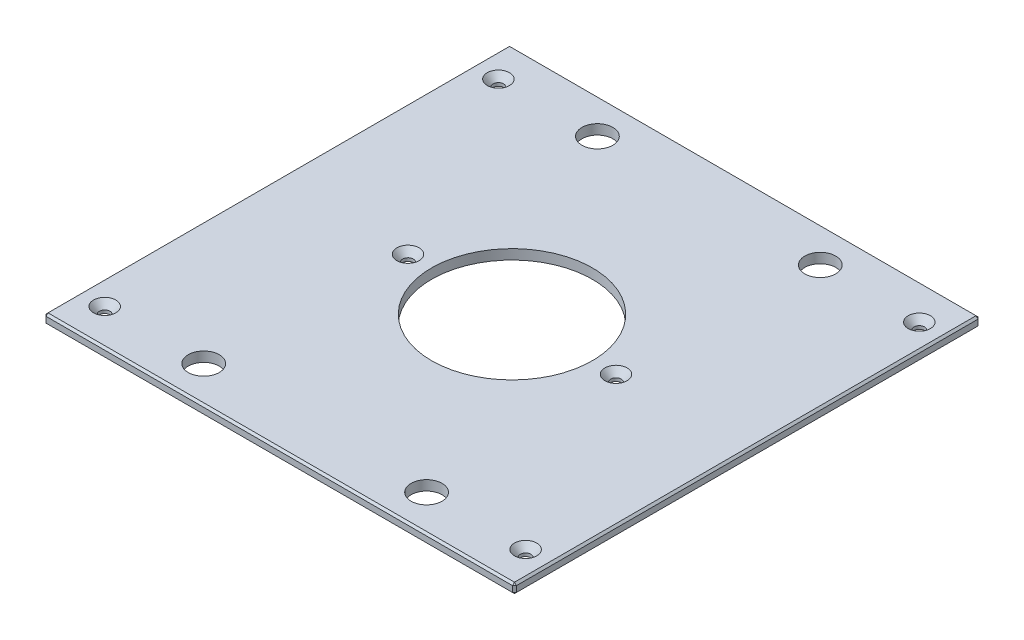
from build123d import *

# Parameters (mm, degrees)
SKETCH1_W                                     = 301.625
SKETCH1_H                                     = 298.45
BOSS_EXTRUDE1_DEPTH                           = 6.35
SKETCH13_R                                    = 51.562
CUT_EXTRUDE6_DEPTH                            = 213.256527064
F_25_32_0_78125_DIAMETER_HOLE1_D              = 19.84375
CHAMFER2_SIZE                                 = 1.27
CSK_FOR_1_4_FLAT_HEAD_MACHINE_SCREW1_AT_COUNT = 2
CSK_FOR_1_4_FLAT_HEAD_MACHINE_SCREW1_AT_PITCH = 252.40996
CSK_FOR_1_4_FLAT_HEAD_MACHINE_SCREW1_2_COUNT  = 2
CSK_FOR_1_4_FLAT_HEAD_MACHINE_SCREW1_2_PITCH  = 369.517663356
CSK_FOR_1_4_FLAT_HEAD_MACHINE_SCREW1_3_COUNT  = 2
CSK_FOR_1_4_FLAT_HEAD_MACHINE_SCREW1_3_PITCH  = 237.855622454
CSK_FOR_1_4_FLAT_HEAD_MACHINE_SCREW1_4_COUNT  = 2
CSK_FOR_1_4_FLAT_HEAD_MACHINE_SCREW1_4_PITCH  = 143.483329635
CSK_FOR_1_4_FLAT_HEAD_MACHINE_SCREW1_5_COUNT  = 2
CSK_FOR_1_4_FLAT_HEAD_MACHINE_SCREW1_5_PITCH  = 269.875
CSK_FOR_1_4_FLAT_HEAD_MACHINE_SCREW1_6_COUNT  = 2
CSK_FOR_1_4_FLAT_HEAD_MACHINE_SCREW1_6_PITCH  = 206.375
CSK_FOR_1_4_FLAT_HEAD_MACHINE_SCREW1_7_COUNT  = 2
CSK_FOR_1_4_FLAT_HEAD_MACHINE_SCREW1_7_PITCH  = 326.038998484


with BuildPart() as part:
    # Sketch1 → Boss-Extrude1 (new body)
    with BuildSketch(Plane(origin=(0, 0, 0), x_dir=(1, 0, 0), z_dir=(0, 1, 0))):
        Rectangle(SKETCH1_W, SKETCH1_H)
    extrude(amount=BOSS_EXTRUDE1_DEPTH)

    # Sketch13 → Cut-Extrude6 (cut, through all)
    with BuildSketch(Plane(origin=(0, 6.35, 0), x_dir=(1, 0, 0), z_dir=(0, 1, 0))):
        with Locations(Location((0, 0, 0), (0, 0, 270))):
            Circle(SKETCH13_R)
    extrude(amount=-CUT_EXTRUDE6_DEPTH, mode=Mode.SUBTRACT)

    # 25_32 _0.78125_ Diameter Hole1 (through all)
    with Locations(Plane(origin=(0, 6.35, 0), x_dir=(1, 0, 0), z_dir=(0, 1, 0))):
        with Locations((71.4375, 126.20498), (-71.4375, 126.20498), (71.4375, -126.20498), (-71.4375, -126.20498)):
            Hole(F_25_32_0_78125_DIAMETER_HOLE1_D / 2)

    # Chamfer2
    chamfer2_edges = [part.edges().sort_by_distance(p)[0] for p in [
        (150.8125, 6.35, 0),
        (0, 6.35, -149.225),
        (-150.8125, 6.35, 0),
        (0, 0, -149.225),
        (150.8125, 0, 0),
        (0, 0, 149.225),
        (-150.8125, 0, 0),
        (0, 6.35, 149.225),
        (-150.8125, 3.175, -149.225),
        (150.8125, 3.175, -149.225),
        (150.8125, 3.175, 149.225),
        (-150.8125, 3.175, 149.225),
    ]]
    chamfer(chamfer2_edges, length=CHAMFER2_SIZE)

    # Sketch24 → CSK for 1_4 Flat Head Machine Screw1 (revolve, cut)
    with BuildSketch(Plane(origin=(134.9375, 6.35, -126.20498), x_dir=(0, 0, 1), z_dir=(1, 0, 0))):
        Polygon((0, 0), (0, 6.35), (3.3782, 6.35), (3.3782, 4.324464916), (7.1374, 0), align=None)
    csk_for_1_4_flat_head_machine_screw1 = revolve(axis=Axis((134.9375, 12.7, -126.20498), (0, -1, 0)), mode=Mode.SUBTRACT)

    # CSK for 1_4 Flat Head Machine Screw1 at: CSK for 1_4 Flat Head Machine Screw1 ×2
    with Locations(*[(0, 0, i * CSK_FOR_1_4_FLAT_HEAD_MACHINE_SCREW1_AT_PITCH) for i in range(1, CSK_FOR_1_4_FLAT_HEAD_MACHINE_SCREW1_AT_COUNT)]):
        add(csk_for_1_4_flat_head_machine_screw1, mode=Mode.SUBTRACT)

    # CSK for 1_4 Flat Head Machine Screw1 2: CSK for 1_4 Flat Head Machine Screw1 ×2
    with Locations(*[Vector(-0.7303439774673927, 0, 0.6830795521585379) * (i * CSK_FOR_1_4_FLAT_HEAD_MACHINE_SCREW1_2_PITCH) for i in range(1, CSK_FOR_1_4_FLAT_HEAD_MACHINE_SCREW1_2_COUNT)]):
        add(csk_for_1_4_flat_head_machine_screw1, mode=Mode.SUBTRACT)

    # CSK for 1_4 Flat Head Machine Screw1 3: CSK for 1_4 Flat Head Machine Screw1 ×2
    with Locations(*[Vector(-0.8476255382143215, 0, 0.5305948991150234) * (i * CSK_FOR_1_4_FLAT_HEAD_MACHINE_SCREW1_3_PITCH) for i in range(1, CSK_FOR_1_4_FLAT_HEAD_MACHINE_SCREW1_3_COUNT)]):
        add(csk_for_1_4_flat_head_machine_screw1, mode=Mode.SUBTRACT)

    # CSK for 1_4 Flat Head Machine Screw1 4: CSK for 1_4 Flat Head Machine Screw1 ×2
    with Locations(*[Vector(-0.4757521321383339, 0, 0.8795793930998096) * (i * CSK_FOR_1_4_FLAT_HEAD_MACHINE_SCREW1_4_PITCH) for i in range(1, CSK_FOR_1_4_FLAT_HEAD_MACHINE_SCREW1_4_COUNT)]):
        add(csk_for_1_4_flat_head_machine_screw1, mode=Mode.SUBTRACT)

    # CSK for 1_4 Flat Head Machine Screw1 5: CSK for 1_4 Flat Head Machine Screw1 ×2
    with Locations(*[(-i * CSK_FOR_1_4_FLAT_HEAD_MACHINE_SCREW1_5_PITCH, 0, 0) for i in range(1, CSK_FOR_1_4_FLAT_HEAD_MACHINE_SCREW1_5_COUNT)]):
        add(csk_for_1_4_flat_head_machine_screw1, mode=Mode.SUBTRACT)

    # CSK for 1_4 Flat Head Machine Screw1 6: CSK for 1_4 Flat Head Machine Screw1 ×2
    with Locations(*[(-i * CSK_FOR_1_4_FLAT_HEAD_MACHINE_SCREW1_6_PITCH, 0, 0) for i in range(1, CSK_FOR_1_4_FLAT_HEAD_MACHINE_SCREW1_6_COUNT)]):
        add(csk_for_1_4_flat_head_machine_screw1, mode=Mode.SUBTRACT)

    # CSK for 1_4 Flat Head Machine Screw1 7: CSK for 1_4 Flat Head Machine Screw1 ×2
    with Locations(*[Vector(-0.6329764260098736, 0, 0.7741710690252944) * (i * CSK_FOR_1_4_FLAT_HEAD_MACHINE_SCREW1_7_PITCH) for i in range(1, CSK_FOR_1_4_FLAT_HEAD_MACHINE_SCREW1_7_COUNT)]):
        add(csk_for_1_4_flat_head_machine_screw1, mode=Mode.SUBTRACT)


solid = part.part
